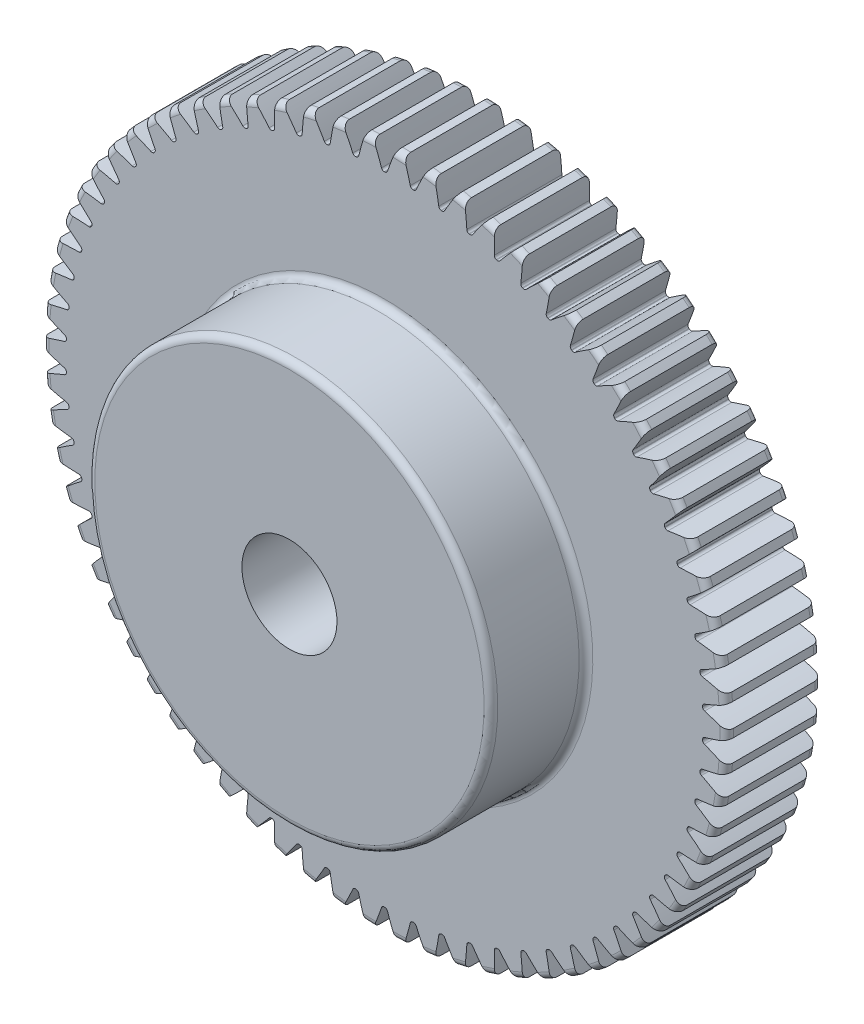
from build123d import *

# Parameters (mm, degrees)
FILLET2_R          = 0.9144
CUT_EXTRUDE2_DEPTH = 66.893298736
CIRPATTERN1_COUNT  = 70
FILLET3_R          = 1.016


with BuildPart() as part:
    # Sketch4 → Revolve1 (revolve)
    with BuildSketch(Plane(origin=(0, 0, 0), x_dir=(0, 0, -1), z_dir=(1, 0, 0))):
        Polygon((-25.4, 6.35), (-25.4, 26.924), (-12.7, 26.924), (-12.7, 45.72), (0, 45.72), (0, 6.35), align=None)
    revolve(axis=Axis((0, 0, 12.7), (0, 0, 1)))

    # Fillet2
    fillet2_edges = [part.edges().sort_by_distance(p)[0] for p in [
        (0, -45.72, 0),
        (0, -45.72, 12.7),
        (0, -26.924, 12.7),
        (0, -26.924, 25.4),
    ]]
    fillet(fillet2_edges, radius=FILLET2_R)

    # Sketch7 → Cut-Extrude2 (cut, through all)
    with BuildSketch(Plane.XY.offset(12.7)):
        with BuildLine():
            ThreePointArc((-0.035776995, 42.544984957), (0, 42.545), (0.035776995, 42.544984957))
            ThreePointArc((0.035776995, 42.544984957), (0.257128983, 42.615646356), (0.396284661, 42.80172546))
            ThreePointArc((0.396284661, 42.80172546), (0.927425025, 44.258110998), (1.50902682, 45.695089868))
            ThreePointArc((1.50902682, 45.695089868), (0, 45.72), (-1.50902682, 45.695089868))
            ThreePointArc((-1.50902682, 45.695089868), (-0.927425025, 44.258110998), (-0.396284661, 42.80172546))
            ThreePointArc((-0.396284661, 42.80172546), (-0.257128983, 42.615646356), (-0.035776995, 42.544984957))
        make_face()
    cut_extrude2 = extrude(amount=-CUT_EXTRUDE2_DEPTH, mode=Mode.SUBTRACT)

    # CirPattern1: Cut-Extrude2 ×70 about axis
    cirpattern1_axis = Axis((0, 0, 0), (0, 0, 1))
    for i in range(1, CIRPATTERN1_COUNT):
        add(cut_extrude2.rotate(cirpattern1_axis, i * 360 / CIRPATTERN1_COUNT), mode=Mode.SUBTRACT)

    # Fillet3
    fillet3_edges = [part.edges().sort_by_distance(p)[0] for p in [
        (0, -6.35, 0),
    ]]
    fillet(fillet3_edges, radius=FILLET3_R)


solid = part.part
